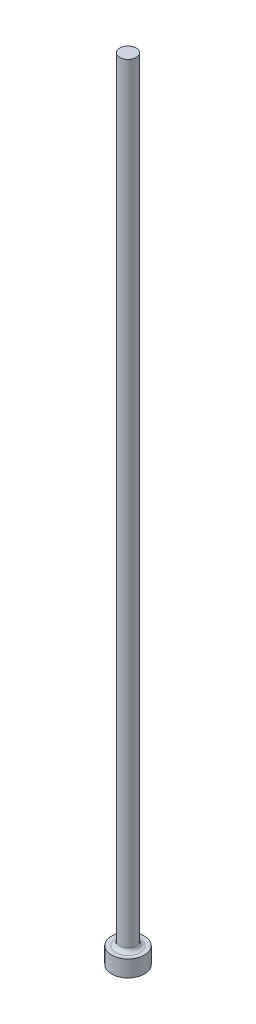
ISO-10303-21;
HEADER;
FILE_DESCRIPTION(('STEP AP214'),'2;1');
FILE_NAME('part.step','',(''),(''),'','','');
FILE_SCHEMA(('AUTOMOTIVE_DESIGN { 1 0 10303 214 1 1 1 1 }'));
ENDSEC;
DATA;
#1=APPLICATION_CONTEXT('core data for automotive mechanical design processes');
#2=APPLICATION_PROTOCOL_DEFINITION('international standard','automotive_design',2000,#1);
#3=PRODUCT_CONTEXT('',#1,'mechanical');
#4=PRODUCT('Part','Part','',(#3));
#5=PRODUCT_RELATED_PRODUCT_CATEGORY('part','',(#4));
#6=PRODUCT_DEFINITION_FORMATION('','',#4);
#7=PRODUCT_DEFINITION_CONTEXT('part definition',#1,'design');
#8=PRODUCT_DEFINITION('design','',#6,#7);
#9=PRODUCT_DEFINITION_SHAPE('','',#8);
#10=(LENGTH_UNIT() NAMED_UNIT(*) SI_UNIT(.MILLI.,.METRE.));
#11=(NAMED_UNIT(*) PLANE_ANGLE_UNIT() SI_UNIT($,.RADIAN.));
#12=(NAMED_UNIT(*) SI_UNIT($,.STERADIAN.) SOLID_ANGLE_UNIT());
#13=UNCERTAINTY_MEASURE_WITH_UNIT(LENGTH_MEASURE(1.E-05),#10,'distance_accuracy_value','');
#14=(GEOMETRIC_REPRESENTATION_CONTEXT(3) GLOBAL_UNCERTAINTY_ASSIGNED_CONTEXT((#13)) GLOBAL_UNIT_ASSIGNED_CONTEXT((#10,
#11,#12)) REPRESENTATION_CONTEXT('',''));
#15=CARTESIAN_POINT('',(0.,0.,0.));
#16=DIRECTION('',(0.,0.,1.));
#17=DIRECTION('',(1.,0.,0.));
#18=AXIS2_PLACEMENT_3D('',#15,#16,#17);
#19=CARTESIAN_POINT('',(1.5875,152.4,0.));
#20=DIRECTION('',(0.,-1.,0.));
#21=DIRECTION('',(1.,0.,0.));
#22=AXIS2_PLACEMENT_3D('',#19,#20,#21);
#23=PLANE('',#22);
#24=CARTESIAN_POINT('',(0.,152.4,0.));
#25=DIRECTION('',(0.,1.,0.));
#26=DIRECTION('',(-1.,0.,0.));
#27=AXIS2_PLACEMENT_3D('',#24,#25,#26);
#28=CIRCLE('',#27,1.5875);
#29=CARTESIAN_POINT('',(-1.5875,152.4,0.));
#30=VERTEX_POINT('',#29);
#31=EDGE_CURVE('E10',#30,#30,#28,.T.);
#32=ORIENTED_EDGE('',*,*,#31,.T.);
#33=EDGE_LOOP('',(#32));
#34=FACE_BOUND('',#33,.T.);
#35=ADVANCED_FACE('F30',(#34),#23,.F.);
#36=CARTESIAN_POINT('',(0.,152.4,0.));
#37=DIRECTION('',(0.,1.,0.));
#38=DIRECTION('',(-1.,0.,0.));
#39=AXIS2_PLACEMENT_3D('',#36,#37,#38);
#40=CYLINDRICAL_SURFACE('',#39,1.5875);
#41=ORIENTED_EDGE('',*,*,#31,.F.);
#42=EDGE_LOOP('',(#41));
#43=FACE_BOUND('',#42,.T.);
#44=CARTESIAN_POINT('',(0.,3.937,0.));
#45=DIRECTION('',(0.,1.,0.));
#46=DIRECTION('',(-1.,0.,0.));
#47=AXIS2_PLACEMENT_3D('',#44,#45,#46);
#48=CIRCLE('',#47,1.5875);
#49=CARTESIAN_POINT('',(-1.5875,3.937,0.));
#50=VERTEX_POINT('',#49);
#51=EDGE_CURVE('E36',#50,#50,#48,.T.);
#52=ORIENTED_EDGE('',*,*,#51,.T.);
#53=EDGE_LOOP('',(#52));
#54=FACE_BOUND('',#53,.T.);
#55=ADVANCED_FACE('F65',(#43,#54),#40,.T.);
#56=CARTESIAN_POINT('',(0.,3.937,0.));
#57=DIRECTION('',(0.,1.,0.));
#58=DIRECTION('',(-1.,0.,0.));
#59=AXIS2_PLACEMENT_3D('',#56,#57,#58);
#60=TOROIDAL_SURFACE('',#59,2.3495,0.762);
#61=ORIENTED_EDGE('',*,*,#51,.F.);
#62=EDGE_LOOP('',(#61));
#63=FACE_BOUND('',#62,.T.);
#64=CARTESIAN_POINT('',(0.,3.17500000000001,0.));
#65=DIRECTION('',(0.,1.,0.));
#66=DIRECTION('',(-1.,0.,0.));
#67=AXIS2_PLACEMENT_3D('',#64,#65,#66);
#68=CIRCLE('',#67,2.34950000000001);
#69=CARTESIAN_POINT('',(-2.34950000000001,3.17500000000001,0.));
#70=VERTEX_POINT('',#69);
#71=EDGE_CURVE('E40',#70,#70,#68,.T.);
#72=ORIENTED_EDGE('',*,*,#71,.T.);
#73=EDGE_LOOP('',(#72));
#74=FACE_BOUND('',#73,.T.);
#75=ADVANCED_FACE('F69',(#63,#74),#60,.F.);
#76=CARTESIAN_POINT('',(3.175,3.175,0.));
#77=DIRECTION('',(0.,-1.,0.));
#78=DIRECTION('',(1.,0.,0.));
#79=AXIS2_PLACEMENT_3D('',#76,#77,#78);
#80=PLANE('',#79);
#81=ORIENTED_EDGE('',*,*,#71,.F.);
#82=EDGE_LOOP('',(#81));
#83=FACE_BOUND('',#82,.T.);
#84=CARTESIAN_POINT('',(0.,3.17500000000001,0.));
#85=DIRECTION('',(0.,1.,0.));
#86=DIRECTION('',(-1.,0.,0.));
#87=AXIS2_PLACEMENT_3D('',#84,#85,#86);
#88=CIRCLE('',#87,3.175);
#89=CARTESIAN_POINT('',(-3.175,3.17500000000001,0.));
#90=VERTEX_POINT('',#89);
#91=EDGE_CURVE('E44',#90,#90,#88,.T.);
#92=ORIENTED_EDGE('',*,*,#91,.T.);
#93=EDGE_LOOP('',(#92));
#94=FACE_BOUND('',#93,.T.);
#95=ADVANCED_FACE('F61',(#83,#94),#80,.F.);
#96=CARTESIAN_POINT('',(0.,152.4,0.));
#97=DIRECTION('',(0.,1.,0.));
#98=DIRECTION('',(-1.,0.,0.));
#99=AXIS2_PLACEMENT_3D('',#96,#97,#98);
#100=CYLINDRICAL_SURFACE('',#99,3.175);
#101=ORIENTED_EDGE('',*,*,#91,.F.);
#102=EDGE_LOOP('',(#101));
#103=FACE_BOUND('',#102,.T.);
#104=CARTESIAN_POINT('',(0.,0.,0.));
#105=DIRECTION('',(0.,1.,0.));
#106=DIRECTION('',(-1.,0.,0.));
#107=AXIS2_PLACEMENT_3D('',#104,#105,#106);
#108=CIRCLE('',#107,3.175);
#109=CARTESIAN_POINT('',(-3.175,0.,0.));
#110=VERTEX_POINT('',#109);
#111=EDGE_CURVE('E49',#110,#110,#108,.T.);
#112=ORIENTED_EDGE('',*,*,#111,.T.);
#113=EDGE_LOOP('',(#112));
#114=FACE_BOUND('',#113,.T.);
#115=ADVANCED_FACE('F53',(#103,#114),#100,.T.);
#116=CARTESIAN_POINT('',(0.,0.,0.));
#117=DIRECTION('',(0.,1.,0.));
#118=DIRECTION('',(-1.,0.,0.));
#119=AXIS2_PLACEMENT_3D('',#116,#117,#118);
#120=PLANE('',#119);
#121=ORIENTED_EDGE('',*,*,#111,.F.);
#122=EDGE_LOOP('',(#121));
#123=FACE_BOUND('',#122,.T.);
#124=ADVANCED_FACE('F55',(#123),#120,.F.);
#125=CLOSED_SHELL('',(#35,#55,#75,#95,#115,#124));
#126=MANIFOLD_SOLID_BREP('B2',#125);
#127=ADVANCED_BREP_SHAPE_REPRESENTATION('',(#18,#126),#14);
#128=SHAPE_DEFINITION_REPRESENTATION(#9,#127);
ENDSEC;
END-ISO-10303-21;
